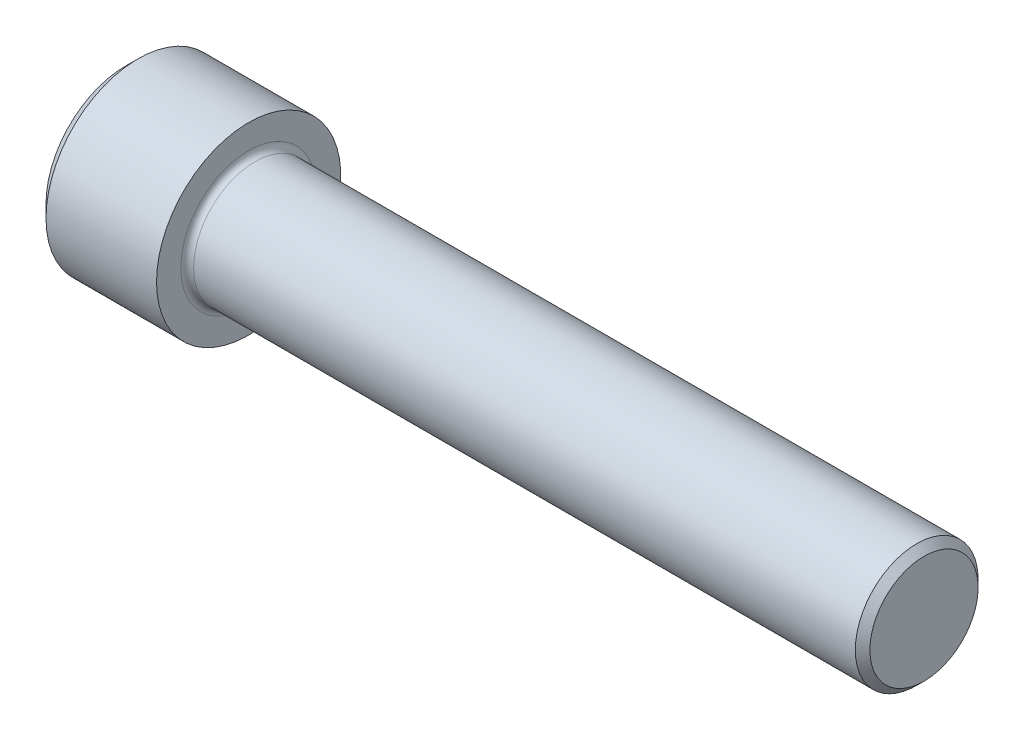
from build123d import *

# Parameters (mm, degrees)
FILLET1_R   = 0.6604
HEX_2_DEPTH = 6.223


with BuildPart() as part:
    # BodySke → Base-Revolve (revolve)
    with BuildSketch(Plane.XY, mode=Mode.PRIVATE) as base_revolve_sk:
        Polygon((0, 0), (0, 8.255), (1.27, 9.525), (12.7, 9.525), (12.7, 6.35), (81.79435, 6.35), (82.55, 5.59435), (82.55, 0), align=None)
    revolve(base_revolve_sk.sketch.rotate(Axis((-31.75, 0, 0), (1, 0, 0)), 90), axis=Axis((-31.75, 0, 0), (1, 0, 0)))

    # Fillet1
    fillet1_edges = [part.edges().sort_by_distance(p)[0] for p in [
        (12.7, 0, -6.35),
    ]]
    fillet(fillet1_edges, radius=FILLET1_R)

    # Sketch2 → Hex-PreBroach (revolve, cut)
    with BuildSketch(Plane.XY, mode=Mode.PRIVATE) as hex_prebroach_sk:
        Polygon((0, 4.7625), (6.223, 4.7625), (8.972630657, 0), (0, 0), align=None)
    revolve(hex_prebroach_sk.sketch.rotate(Axis((0, 0, 0), (1, 0, 0)), 90), axis=Axis((0, 0, 0), (1, 0, 0)), mode=Mode.SUBTRACT)

    # Sketch3 → Hex 2 (cut)
    with BuildSketch(Plane(origin=(0, 0, 0), x_dir=(0, 0.500000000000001, 0.866025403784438), z_dir=(-1, 0, 0))):
        Polygon((2.749630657, 4.7625), (-2.749630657, 4.7625), (-5.499261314, 0), (-2.749630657, -4.7625), (2.749630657, -4.7625), (5.499261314, 0), align=None)
    extrude(amount=-HEX_2_DEPTH, mode=Mode.SUBTRACT)


solid = part.part
